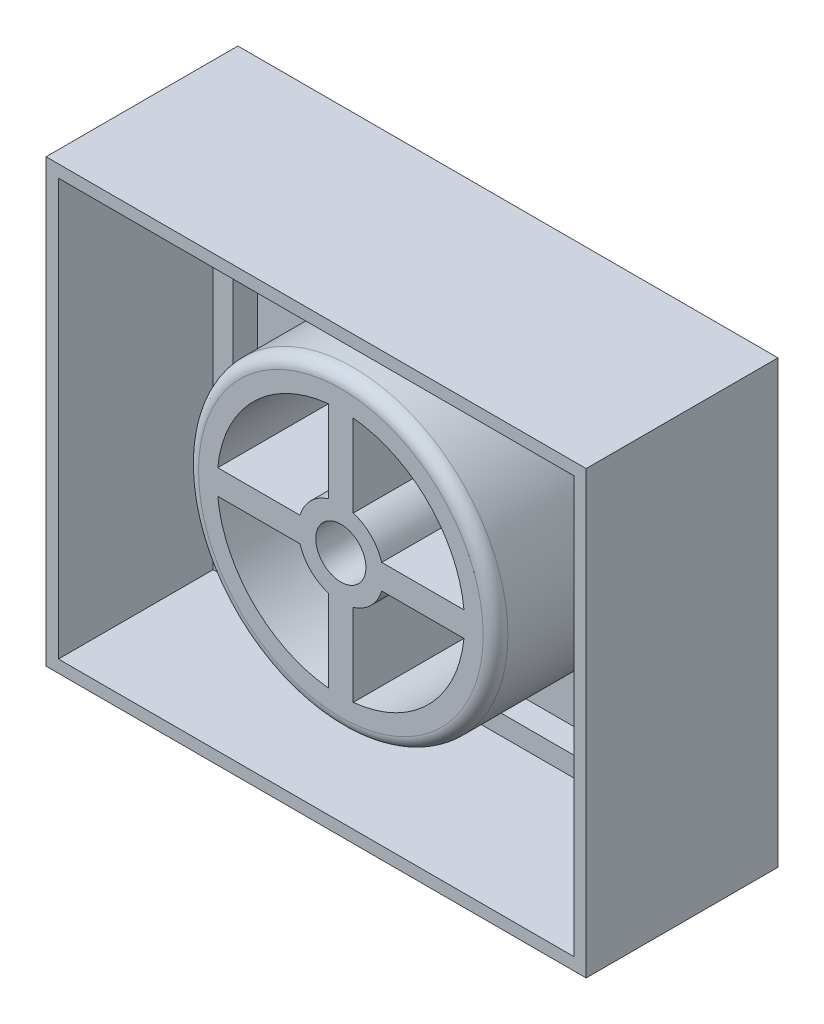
from build123d import *

# Parameters (mm, degrees)
SKETCH1_R           = 25
SKETCH1_R_2         = 4.05
BOSS_EXTRUDE1_DEPTH = 25
SKETCH2_W           = 87.295870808
SKETCH2_H           = 71.305157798
BOSS_EXTRUDE2_DEPTH = 2
SKETCH3_W           = 87.295870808
SKETCH3_H           = 71.305157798
SKETCH3_W_2         = 83.295870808
SKETCH3_H_2         = 67.305157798
BOSS_EXTRUDE3_DEPTH = 29
SKETCH4_W           = 83.295870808
SKETCH4_H           = 67.305157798
SKETCH4_W_2         = 76.895870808
SKETCH4_H_2         = 60.905157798
BOSS_EXTRUDE4_DEPTH = 4
FILLET1_R           = 2


with BuildPart() as part:
    # Sketch1 → Boss-Extrude1 (new body)
    with BuildSketch(Plane.XY):
        with Locations((-10.186001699, 5.215828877)):
            Circle(SKETCH1_R)
        with Locations((-10.186001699, 5.215828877)):
            Circle(SKETCH1_R_2, mode=Mode.SUBTRACT)
        with BuildLine():
            Line((-3.582214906, 3.215828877), (9.713747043, 3.215828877))
            ThreePointArc((9.713747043, 3.215828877), (3.956133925, -8.926306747), (-8.186001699, -14.683919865))
            Line((-8.186001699, -14.683919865), (-8.186001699, -1.387957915))
            ThreePointArc((-8.186001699, -1.387957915), (-5.306964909, 0.336792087), (-3.582214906, 3.215828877))
        make_face(mode=Mode.SUBTRACT)
        with BuildLine():
            Line((-3.582214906, 7.215828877), (9.713747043, 7.215828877))
            ThreePointArc((9.713747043, 7.215828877), (3.956133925, 19.357964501), (-8.186001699, 25.115577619))
            Line((-8.186001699, 25.115577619), (-8.186001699, 11.819615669))
            ThreePointArc((-8.186001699, 11.819615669), (-5.306964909, 10.094865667), (-3.582214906, 7.215828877))
        make_face(mode=Mode.SUBTRACT)
        with BuildLine():
            Line((-12.186001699, -1.387957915), (-12.186001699, -14.683919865))
            ThreePointArc((-12.186001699, -14.683919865), (-24.328137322, -8.926306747), (-30.085750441, 3.215828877))
            Line((-30.085750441, 3.215828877), (-16.789788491, 3.215828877))
            ThreePointArc((-16.789788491, 3.215828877), (-15.065038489, 0.336792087), (-12.186001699, -1.387957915))
        make_face(mode=Mode.SUBTRACT)
        with BuildLine():
            Line((-16.789788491, 7.215828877), (-30.085750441, 7.215828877))
            ThreePointArc((-30.085750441, 7.215828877), (-24.328137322, 19.357964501), (-12.186001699, 25.115577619))
            Line((-12.186001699, 25.115577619), (-12.186001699, 11.819615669))
            ThreePointArc((-12.186001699, 11.819615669), (-15.065038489, 10.094865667), (-16.789788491, 7.215828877))
        make_face(mode=Mode.SUBTRACT)
    extrude(amount=BOSS_EXTRUDE1_DEPTH)

    # Sketch2 → Boss-Extrude2 (add)
    with BuildSketch(Plane(origin=(0, 0, 0), x_dir=(-1, 0, 0), z_dir=(0, 0, -1))):
        with Locations((10.186001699, 5.215828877)):
            Rectangle(SKETCH2_W, SKETCH2_H)
    extrude(amount=BOSS_EXTRUDE2_DEPTH)

    # Sketch3 → Boss-Extrude3 (add)
    with BuildSketch(Plane.XY):
        with Locations((-10.186001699, 5.215828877)):
            Rectangle(SKETCH3_W, SKETCH3_H)
        with Locations((-10.186001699, 5.215828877)):
            Rectangle(SKETCH3_W_2, SKETCH3_H_2, mode=Mode.SUBTRACT)
    extrude(amount=BOSS_EXTRUDE3_DEPTH)

    # Sketch4 → Boss-Extrude4 (add)
    with BuildSketch(Plane.XY):
        with Locations((-10.186001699, 5.215828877)):
            Rectangle(SKETCH4_W, SKETCH4_H)
        with Locations((-10.186001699, 5.215828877)):
            Rectangle(SKETCH4_W_2, SKETCH4_H_2, mode=Mode.SUBTRACT)
    extrude(amount=BOSS_EXTRUDE4_DEPTH)

    # Fillet1
    fillet1_edges = [part.edges().sort_by_distance(p)[0] for p in [
        (-35.186001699, 5.215828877, 25),
    ]]
    fillet(fillet1_edges, radius=FILLET1_R)


solid = part.part
